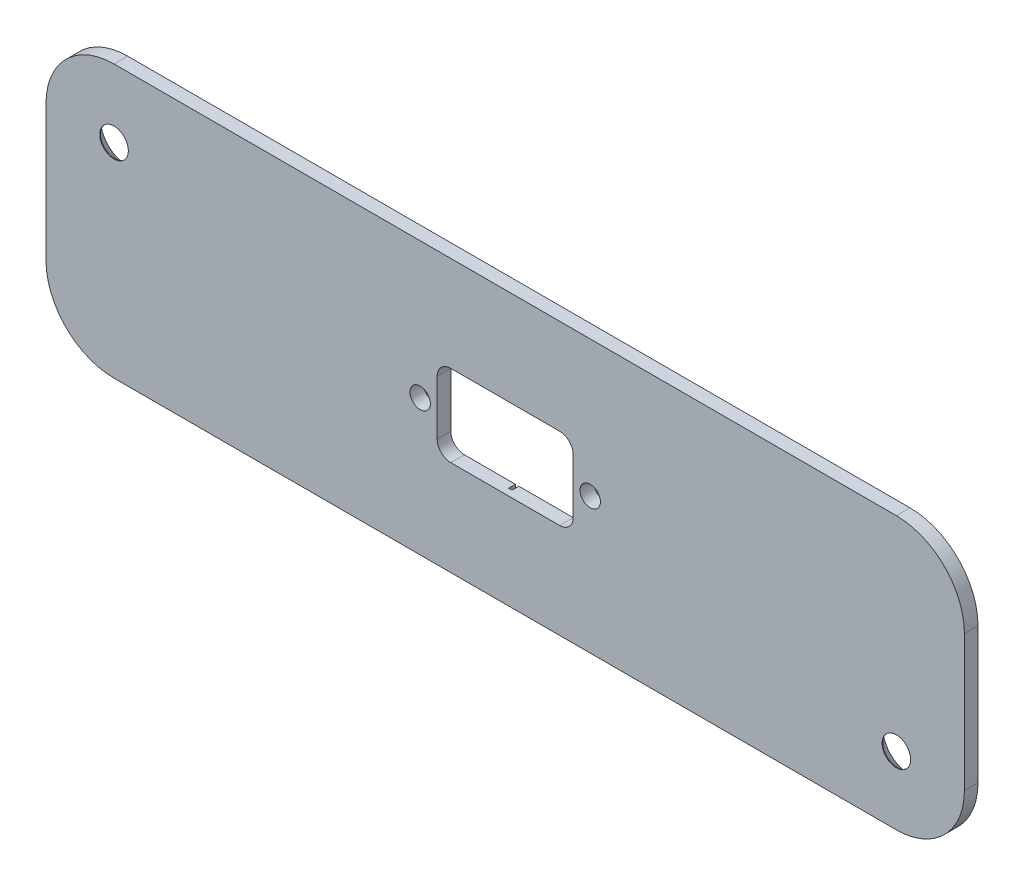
from build123d import *

# Parameters (mm, degrees)
ESQUISSE1_W             = 135
ESQUISSE1_H             = 40
BOSS_EXTRU_1_DEPTH      = 2
ESQUISSE2_R             = 2.1
ENL_V_MAT_EXTRU_1_DEPTH = 2
CHANFREIN1_SIZE         = 1.9
ESQUISSE3_R             = 1.5
ESQUISSE3_W             = 20
ESQUISSE3_H             = 12
ENL_V_MAT_EXTRU_2_DEPTH = 141.815482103
CONG_2_R                = 2
CONG_3_R                = 10
ESQUISSE4_W             = 0.5
ESQUISSE4_H             = 10
ENL_V_MAT_EXTRU_3_DEPTH = 1


with BuildPart() as part:
    # Esquisse1 → Boss.-Extru.1 (new body)
    with BuildSketch(Plane.XY):
        with Locations((67.5, 20)):
            Rectangle(ESQUISSE1_W, ESQUISSE1_H)
    extrude(amount=BOSS_EXTRU_1_DEPTH)

    # Esquisse2 → Enl_v. mat.-Extru.1 (cut)
    with BuildSketch(Plane.XY.offset(2)):
        with Locations((10, 30)):
            Circle(ESQUISSE2_R)
        with Locations((125, 10)):
            Circle(ESQUISSE2_R)
    extrude(amount=-ENL_V_MAT_EXTRU_1_DEPTH, mode=Mode.SUBTRACT)

    # Chanfrein1
    chanfrein1_edges = [part.edges().sort_by_distance(p)[0] for p in [
        (7.9, 30, 0),
        (122.9, 10, 0),
    ]]
    chamfer(chanfrein1_edges, length=CHANFREIN1_SIZE)

    # Esquisse3 → Enl_v. mat.-Extru.2 (cut, through all)
    with BuildSketch(Plane(origin=(0, 0, 0), x_dir=(-1, 0, 0), z_dir=(0, 0, -1))):
        with Locations((-80, 20)):
            Circle(ESQUISSE3_R)
        with Locations((-55, 20)):
            Circle(ESQUISSE3_R)
        with Locations((-67.5, 20)):
            Rectangle(ESQUISSE3_W, ESQUISSE3_H)
    extrude(amount=-ENL_V_MAT_EXTRU_2_DEPTH, mode=Mode.SUBTRACT)

    # Cong_2
    cong_2_edges = [part.edges().sort_by_distance(p)[0] for p in [
        (77.5, 14, 1),
        (77.5, 26, 1),
        (57.5, 26, 1),
        (57.5, 14, 1),
    ]]
    fillet(cong_2_edges, radius=CONG_2_R)

    # Cong_3
    cong_3_edges = [part.edges().sort_by_distance(p)[0] for p in [
        (0, 40, 1),
        (135, 40, 1),
        (135, 0, 1),
        (0, 0, 1),
    ]]
    fillet(cong_3_edges, radius=CONG_3_R)

    # Esquisse4 → Enl_v. mat.-Extru.3 (cut)
    # profile 1 of 9: a face of its own
    with BuildSketch(Plane(origin=(0, 0, 0), x_dir=(-1, 0, 0), z_dir=(0, 0, -1))):
        with Locations((-67.25, 9)):
            Rectangle(ESQUISSE4_W, ESQUISSE4_H)
    # profile 2 of 9: a face of its own
    with BuildSketch(Plane(origin=(0, 0, 0), x_dir=(-1, 0, 0), z_dir=(0, 0, -1))):
        with BuildLine():
            Line((-84.71225634, 8.358894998), (-85.026358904, 8.358894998))
            add(Edge.make_bspline(
                [(-85.026358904, 8.358894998), (-85.017849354, 8.394127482), (-85.001213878, 8.463004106), (-84.966516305, 8.561411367), (-84.92871705, 8.654534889), (-84.883327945, 8.740630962), (-84.833819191, 8.821429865), (-84.777096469, 8.895098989), (-84.715776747, 8.963511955), (-84.647951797, 9.024225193), (-84.576823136, 9.079202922), (-84.501388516, 9.126077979), (-84.423165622, 9.166402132), (-84.341612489, 9.199622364), (-84.256486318, 9.224647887), (-84.168556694, 9.242804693), (-84.077593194, 9.254595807), (-84.015845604, 9.25574657), (-83.984491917, 9.256330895)],
                knots=[0, 0, 0, 0, 1.162005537, 2.271625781, 3.343758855, 4.383309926, 5.390229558, 6.379919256, 7.361854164, 8.333198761, 9.295911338, 10.242430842, 11.177959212, 12.116337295, 13.062827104, 14.020064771, 14.994644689, 16, 16, 16, 16], degree=3))
            add(Edge.make_bspline(
                [(-83.984491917, 9.256330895), (-83.938809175, 9.254951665), (-83.848440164, 9.25222329), (-83.715677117, 9.227308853), (-83.587650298, 9.187883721), (-83.46576105, 9.133409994), (-83.352542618, 9.066222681), (-83.251806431, 8.986257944), (-83.16491792, 8.895058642), (-83.092023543, 8.794326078), (-83.034948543, 8.686670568), (-82.99286217, 8.575870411), (-82.967240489, 8.46218844), (-82.963919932, 8.385431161), (-82.96225634, 8.346975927)],
                knots=[0, 0, 0, 0, 1.083050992, 2.142477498, 3.193116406, 4.255571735, 5.30263384, 6.308962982, 7.297363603, 8.282367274, 9.249857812, 10.179914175, 11.08814088, 12, 12, 12, 12], degree=3))
            add(Edge.make_bspline(
                [(-82.96225634, 8.346975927), (-82.963419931, 8.309969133), (-82.965696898, 8.237552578), (-82.985030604, 8.131831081), (-83.017566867, 8.032189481), (-83.062636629, 7.938208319), (-83.12097818, 7.850483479), (-83.191650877, 7.768817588), (-83.275153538, 7.69284843), (-83.338432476, 7.649328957), (-83.371010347, 7.626923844)],
                knots=[0, 0, 0, 0, 1.024540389, 2.004866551, 2.965041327, 3.920577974, 4.882998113, 5.874504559, 6.905732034, 8, 8, 8, 8], degree=3))
            add(Edge.make_bspline(
                [(-83.371010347, 7.626923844), (-83.333778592, 7.608945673), (-83.260011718, 7.573325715), (-83.159461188, 7.503469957), (-83.068183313, 7.42281361), (-83.017279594, 7.359870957), (-82.991703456, 7.32824596)],
                knots=[0, 0, 0, 0, 1.015518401, 2.012035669, 3.001164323, 4, 4, 4, 4], degree=3))
            add(Edge.make_bspline(
                [(-82.991703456, 7.32824596), (-82.974862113, 7.305188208), (-82.941455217, 7.259450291), (-82.900219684, 7.185913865), (-82.862810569, 7.111562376), (-82.83366035, 7.03440297), (-82.811086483, 6.955329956), (-82.794950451, 6.87420756), (-82.78492631, 6.790969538), (-82.783490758, 6.734657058), (-82.782769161, 6.706350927)],
                knots=[0, 0, 0, 0, 1.025084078, 2.033381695, 3.024893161, 4.013698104, 4.991890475, 5.976764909, 6.982997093, 8, 8, 8, 8], degree=3))
            add(Edge.make_bspline(
                [(-82.782769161, 6.706350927), (-82.784563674, 6.657341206), (-82.788144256, 6.559552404), (-82.820148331, 6.415077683), (-82.869761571, 6.273852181), (-82.940218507, 6.138777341), (-83.026086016, 6.01239696), (-83.12824334, 5.899320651), (-83.245529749, 5.802122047), (-83.376335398, 5.720911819), (-83.518052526, 5.655993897), (-83.669628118, 5.610936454), (-83.828878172, 5.581590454), (-83.93808547, 5.578443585), (-83.993606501, 5.576843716)],
                knots=[0, 0, 0, 0, 0.955779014, 1.907060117, 2.875433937, 3.871313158, 4.872415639, 5.851225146, 6.836215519, 7.83643374, 8.849228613, 9.86973379, 10.916971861, 12, 12, 12, 12], degree=3))
            add(Edge.make_bspline(
                [(-83.993606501, 5.576843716), (-84.031025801, 5.577711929), (-84.104654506, 5.579420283), (-84.212898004, 5.591098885), (-84.316219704, 5.61242889), (-84.414759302, 5.641132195), (-84.508604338, 5.677523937), (-84.597468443, 5.722842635), (-84.681898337, 5.776154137), (-84.761097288, 5.838087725), (-84.835055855, 5.907369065), (-84.90180858, 5.985228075), (-84.962468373, 6.070225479), (-85.015411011, 6.163348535), (-85.063047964, 6.263393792), (-85.102228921, 6.371642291), (-85.136714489, 6.487126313), (-85.152747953, 6.567604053), (-85.160974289, 6.608894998)],
                knots=[0, 0, 0, 0, 1.048658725, 2.063410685, 3.046034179, 4.001477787, 4.936774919, 5.862367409, 6.792675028, 7.730719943, 8.675894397, 9.627829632, 10.600096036, 11.597688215, 12.626045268, 13.701542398, 14.82072376, 16, 16, 16, 16], degree=3))
            Line((-85.160974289, 6.608894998), (-84.846871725, 6.608894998))
            add(Edge.make_bspline(
                [(-84.846871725, 6.608894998), (-84.838688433, 6.581945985), (-84.822771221, 6.529527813), (-84.795676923, 6.454087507), (-84.764808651, 6.384929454), (-84.731694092, 6.321546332), (-84.696915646, 6.26331393), (-84.658000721, 6.211772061), (-84.617831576, 6.164656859), (-84.587552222, 6.138112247), (-84.572733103, 6.12512096)],
                knots=[0, 0, 0, 0, 1.198163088, 2.33053128, 3.407730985, 4.417276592, 5.372219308, 6.28897303, 7.162600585, 8, 8, 8, 8], degree=3))
            add(Edge.make_bspline(
                [(-84.572733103, 6.12512096), (-84.553136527, 6.110012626), (-84.514003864, 6.079842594), (-84.450235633, 6.041340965), (-84.383170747, 6.00797994), (-84.311356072, 5.982496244), (-84.236341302, 5.960918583), (-84.156913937, 5.946798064), (-84.07377472, 5.937109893), (-84.017006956, 5.936254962), (-83.987997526, 5.935818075)],
                knots=[0, 0, 0, 0, 0.946170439, 1.889420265, 2.845303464, 3.807233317, 4.801018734, 5.828864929, 6.890507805, 8, 8, 8, 8], degree=3))
            add(Edge.make_bspline(
                [(-83.987997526, 5.935818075), (-83.955244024, 5.93643398), (-83.891197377, 5.93763833), (-83.797742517, 5.948714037), (-83.70883507, 5.96484445), (-83.625462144, 5.989757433), (-83.546531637, 6.020538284), (-83.473149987, 6.05918669), (-83.404353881, 6.104531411), (-83.341024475, 6.15607057), (-83.284078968, 6.212492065), (-83.233939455, 6.271505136), (-83.191314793, 6.332860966), (-83.156931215, 6.396899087), (-83.129780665, 6.463354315), (-83.111297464, 6.532413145), (-83.098445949, 6.603510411), (-83.097399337, 6.65183938), (-83.096871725, 6.67620269)],
                knots=[0, 0, 0, 0, 1.217147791, 2.380027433, 3.494444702, 4.572153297, 5.609568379, 6.639424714, 7.649109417, 8.668170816, 9.669597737, 10.625200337, 11.543417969, 12.441394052, 13.322311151, 14.205496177, 15.095365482, 16, 16, 16, 16], degree=3))
            add(Edge.make_bspline(
                [(-83.096871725, 6.67620269), (-83.098402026, 6.708814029), (-83.101455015, 6.773874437), (-83.124763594, 6.869592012), (-83.163102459, 6.961815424), (-83.21677497, 7.048971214), (-83.282110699, 7.129747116), (-83.358475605, 7.201818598), (-83.446503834, 7.261288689), (-83.527523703, 7.302377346), (-83.599288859, 7.330414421), (-83.660704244, 7.349089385), (-83.729460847, 7.364903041), (-83.804727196, 7.379615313), (-83.887070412, 7.392136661), (-83.97640085, 7.402578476), (-84.072736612, 7.410933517), (-84.139427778, 7.414664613), (-84.173794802, 7.416587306)],
                knots=[0, 0, 0, 0, 1.07054697, 2.135767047, 3.216561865, 4.33974944, 5.486079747, 6.621378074, 7.775625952, 8.963672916, 9.598146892, 10.304877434, 11.070270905, 11.915000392, 12.823868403, 13.805723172, 14.86925407, 16, 16, 16, 16], degree=3))
            Line((-84.173794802, 7.416587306), (-84.173794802, 7.775561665))
            add(Edge.make_bspline(
                [(-84.173794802, 7.775561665), (-84.130493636, 7.776296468), (-84.04567729, 7.777735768), (-83.921782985, 7.795143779), (-83.803309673, 7.819224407), (-83.692882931, 7.856109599), (-83.592234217, 7.898949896), (-83.504914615, 7.948802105), (-83.432147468, 8.004216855), (-83.374286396, 8.066049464), (-83.330757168, 8.132364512), (-83.29893037, 8.201481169), (-83.280130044, 8.27400523), (-83.277620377, 8.323499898), (-83.276358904, 8.348378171)],
                knots=[0, 0, 0, 0, 1.321986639, 2.589447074, 3.816329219, 5.01088745, 6.139805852, 7.153945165, 8.075214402, 8.924034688, 9.728124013, 10.488707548, 11.240355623, 12, 12, 12, 12], degree=3))
            add(Edge.make_bspline(
                [(-83.276358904, 8.348378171), (-83.276773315, 8.366655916), (-83.277597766, 8.403018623), (-83.287995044, 8.456143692), (-83.303619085, 8.507644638), (-83.325098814, 8.557302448), (-83.353849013, 8.604772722), (-83.388255, 8.650460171), (-83.4292231, 8.69410395), (-83.476168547, 8.73478427), (-83.526580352, 8.773553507), (-83.581830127, 8.806467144), (-83.640252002, 8.834612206), (-83.701910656, 8.857821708), (-83.767006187, 8.875280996), (-83.835232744, 8.887816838), (-83.906720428, 8.895654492), (-83.95549216, 8.896782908), (-83.980285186, 8.897356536)],
                knots=[0, 0, 0, 0, 0.884392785, 1.759457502, 2.611959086, 3.489218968, 4.37281399, 5.2945488, 6.255912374, 7.266815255, 8.301784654, 9.332968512, 10.37626691, 11.440494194, 12.520033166, 13.637162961, 14.798855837, 16, 16, 16, 16], degree=3))
            add(Edge.make_bspline(
                [(-83.980285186, 8.897356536), (-84.020136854, 8.895965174), (-84.097976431, 8.893247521), (-84.210191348, 8.869444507), (-84.314510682, 8.831466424), (-84.394249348, 8.786133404), (-84.453131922, 8.741382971), (-84.495208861, 8.702300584), (-84.536529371, 8.658867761), (-84.574375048, 8.608409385), (-84.612649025, 8.554342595), (-84.647493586, 8.493918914), (-84.681353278, 8.428714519), (-84.701755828, 8.382618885), (-84.71225634, 8.358894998)],
                knots=[0, 0, 0, 0, 1.472543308, 2.876219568, 4.221790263, 5.565193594, 6.249813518, 6.953379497, 7.687249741, 8.463570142, 9.283606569, 10.136032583, 11.040678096, 12, 12, 12, 12], degree=3))
        make_face()
    # profile 3 of 9: a face of its own
    with BuildSketch(Plane(origin=(0, 0, 0), x_dir=(-1, 0, 0), z_dir=(0, 0, -1))):
        with BuildLine():
            Line((-82.019948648, 8.358894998), (-82.334051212, 8.358894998))
            add(Edge.make_bspline(
                [(-82.334051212, 8.358894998), (-82.325541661, 8.394127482), (-82.308906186, 8.463004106), (-82.274208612, 8.561411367), (-82.236409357, 8.654534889), (-82.191020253, 8.740630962), (-82.141511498, 8.821429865), (-82.084788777, 8.895098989), (-82.023469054, 8.963511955), (-81.955644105, 9.024225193), (-81.884515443, 9.079202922), (-81.809080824, 9.126077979), (-81.73085793, 9.166402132), (-81.649304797, 9.199622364), (-81.564178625, 9.224647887), (-81.476249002, 9.242804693), (-81.385285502, 9.254595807), (-81.323537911, 9.25574657), (-81.292184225, 9.256330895)],
                knots=[0, 0, 0, 0, 1.162005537, 2.271625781, 3.343758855, 4.383309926, 5.390229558, 6.379919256, 7.361854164, 8.333198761, 9.295911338, 10.242430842, 11.177959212, 12.116337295, 13.062827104, 14.020064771, 14.994644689, 16, 16, 16, 16], degree=3))
            add(Edge.make_bspline(
                [(-81.292184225, 9.256330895), (-81.246501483, 9.254951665), (-81.156132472, 9.25222329), (-81.023369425, 9.227308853), (-80.895342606, 9.187883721), (-80.773453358, 9.133409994), (-80.660234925, 9.066222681), (-80.559498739, 8.986257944), (-80.472610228, 8.895058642), (-80.39971585, 8.794326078), (-80.342640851, 8.686670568), (-80.300554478, 8.575870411), (-80.274932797, 8.46218844), (-80.27161224, 8.385431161), (-80.269948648, 8.346975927)],
                knots=[0, 0, 0, 0, 1.083050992, 2.142477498, 3.193116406, 4.255571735, 5.30263384, 6.308962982, 7.297363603, 8.282367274, 9.249857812, 10.179914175, 11.08814088, 12, 12, 12, 12], degree=3))
            add(Edge.make_bspline(
                [(-80.269948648, 8.346975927), (-80.271112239, 8.309969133), (-80.273389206, 8.237552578), (-80.292722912, 8.131831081), (-80.325259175, 8.032189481), (-80.370328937, 7.938208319), (-80.428670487, 7.850483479), (-80.499343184, 7.768817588), (-80.582845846, 7.69284843), (-80.646124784, 7.649328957), (-80.678702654, 7.626923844)],
                knots=[0, 0, 0, 0, 1.024540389, 2.004866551, 2.965041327, 3.920577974, 4.882998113, 5.874504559, 6.905732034, 8, 8, 8, 8], degree=3))
            add(Edge.make_bspline(
                [(-80.678702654, 7.626923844), (-80.6414709, 7.608945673), (-80.567704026, 7.573325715), (-80.467153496, 7.503469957), (-80.375875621, 7.42281361), (-80.324971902, 7.359870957), (-80.299395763, 7.32824596)],
                knots=[0, 0, 0, 0, 1.015518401, 2.012035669, 3.001164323, 4, 4, 4, 4], degree=3))
            add(Edge.make_bspline(
                [(-80.299395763, 7.32824596), (-80.282554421, 7.305188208), (-80.249147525, 7.259450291), (-80.207911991, 7.185913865), (-80.170502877, 7.111562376), (-80.141352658, 7.03440297), (-80.118778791, 6.955329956), (-80.102642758, 6.87420756), (-80.092618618, 6.790969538), (-80.091183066, 6.734657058), (-80.090461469, 6.706350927)],
                knots=[0, 0, 0, 0, 1.025084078, 2.033381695, 3.024893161, 4.013698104, 4.991890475, 5.976764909, 6.982997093, 8, 8, 8, 8], degree=3))
            add(Edge.make_bspline(
                [(-80.090461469, 6.706350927), (-80.092255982, 6.657341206), (-80.095836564, 6.559552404), (-80.127840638, 6.415077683), (-80.177453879, 6.273852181), (-80.247910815, 6.138777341), (-80.333778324, 6.01239696), (-80.435935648, 5.899320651), (-80.553222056, 5.802122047), (-80.684027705, 5.720911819), (-80.825744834, 5.655993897), (-80.977320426, 5.610936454), (-81.13657048, 5.581590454), (-81.245777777, 5.578443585), (-81.301298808, 5.576843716)],
                knots=[0, 0, 0, 0, 0.955779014, 1.907060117, 2.875433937, 3.871313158, 4.872415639, 5.851225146, 6.836215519, 7.83643374, 8.849228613, 9.86973379, 10.916971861, 12, 12, 12, 12], degree=3))
            add(Edge.make_bspline(
                [(-81.301298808, 5.576843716), (-81.338718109, 5.577711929), (-81.412346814, 5.579420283), (-81.520590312, 5.591098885), (-81.623912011, 5.61242889), (-81.722451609, 5.641132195), (-81.816296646, 5.677523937), (-81.905160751, 5.722842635), (-81.989590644, 5.776154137), (-82.068789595, 5.838087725), (-82.142748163, 5.907369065), (-82.209500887, 5.985228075), (-82.27016068, 6.070225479), (-82.323103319, 6.163348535), (-82.370740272, 6.263393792), (-82.409921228, 6.371642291), (-82.444406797, 6.487126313), (-82.460440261, 6.567604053), (-82.468666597, 6.608894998)],
                knots=[0, 0, 0, 0, 1.048658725, 2.063410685, 3.046034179, 4.001477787, 4.936774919, 5.862367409, 6.792675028, 7.730719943, 8.675894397, 9.627829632, 10.600096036, 11.597688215, 12.626045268, 13.701542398, 14.82072376, 16, 16, 16, 16], degree=3))
            Line((-82.468666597, 6.608894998), (-82.154564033, 6.608894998))
            add(Edge.make_bspline(
                [(-82.154564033, 6.608894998), (-82.146380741, 6.581945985), (-82.130463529, 6.529527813), (-82.10336923, 6.454087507), (-82.072500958, 6.384929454), (-82.0393864, 6.321546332), (-82.004607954, 6.26331393), (-81.965693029, 6.211772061), (-81.925523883, 6.164656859), (-81.89524453, 6.138112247), (-81.880425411, 6.12512096)],
                knots=[0, 0, 0, 0, 1.198163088, 2.33053128, 3.407730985, 4.417276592, 5.372219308, 6.28897303, 7.162600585, 8, 8, 8, 8], degree=3))
            add(Edge.make_bspline(
                [(-81.880425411, 6.12512096), (-81.860828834, 6.110012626), (-81.821696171, 6.079842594), (-81.75792794, 6.041340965), (-81.690863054, 6.00797994), (-81.61904838, 5.982496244), (-81.54403361, 5.960918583), (-81.464606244, 5.946798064), (-81.381467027, 5.937109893), (-81.324699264, 5.936254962), (-81.295689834, 5.935818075)],
                knots=[0, 0, 0, 0, 0.946170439, 1.889420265, 2.845303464, 3.807233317, 4.801018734, 5.828864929, 6.890507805, 8, 8, 8, 8], degree=3))
            add(Edge.make_bspline(
                [(-81.295689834, 5.935818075), (-81.262936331, 5.93643398), (-81.198889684, 5.93763833), (-81.105434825, 5.948714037), (-81.016527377, 5.96484445), (-80.933154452, 5.989757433), (-80.854223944, 6.020538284), (-80.780842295, 6.05918669), (-80.712046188, 6.104531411), (-80.648716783, 6.15607057), (-80.591771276, 6.212492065), (-80.541631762, 6.271505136), (-80.499007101, 6.332860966), (-80.464623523, 6.396899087), (-80.437472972, 6.463354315), (-80.418989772, 6.532413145), (-80.406138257, 6.603510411), (-80.405091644, 6.65183938), (-80.404564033, 6.67620269)],
                knots=[0, 0, 0, 0, 1.217147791, 2.380027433, 3.494444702, 4.572153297, 5.609568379, 6.639424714, 7.649109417, 8.668170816, 9.669597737, 10.625200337, 11.543417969, 12.441394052, 13.322311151, 14.205496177, 15.095365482, 16, 16, 16, 16], degree=3))
            add(Edge.make_bspline(
                [(-80.404564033, 6.67620269), (-80.406094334, 6.708814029), (-80.409147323, 6.773874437), (-80.432455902, 6.869592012), (-80.470794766, 6.961815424), (-80.524467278, 7.048971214), (-80.589803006, 7.129747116), (-80.666167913, 7.201818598), (-80.754196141, 7.261288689), (-80.83521601, 7.302377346), (-80.906981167, 7.330414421), (-80.968396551, 7.349089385), (-81.037153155, 7.364903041), (-81.112419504, 7.379615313), (-81.19476272, 7.392136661), (-81.284093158, 7.402578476), (-81.38042892, 7.410933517), (-81.447120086, 7.414664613), (-81.48148711, 7.416587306)],
                knots=[0, 0, 0, 0, 1.07054697, 2.135767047, 3.216561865, 4.33974944, 5.486079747, 6.621378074, 7.775625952, 8.963672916, 9.598146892, 10.304877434, 11.070270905, 11.915000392, 12.823868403, 13.805723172, 14.86925407, 16, 16, 16, 16], degree=3))
            Line((-81.48148711, 7.416587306), (-81.48148711, 7.775561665))
            add(Edge.make_bspline(
                [(-81.48148711, 7.775561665), (-81.438185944, 7.776296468), (-81.353369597, 7.777735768), (-81.229475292, 7.795143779), (-81.11100198, 7.819224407), (-81.000575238, 7.856109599), (-80.899926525, 7.898949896), (-80.812606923, 7.948802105), (-80.739839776, 8.004216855), (-80.681978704, 8.066049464), (-80.638449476, 8.132364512), (-80.606622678, 8.201481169), (-80.587822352, 8.27400523), (-80.585312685, 8.323499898), (-80.584051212, 8.348378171)],
                knots=[0, 0, 0, 0, 1.321986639, 2.589447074, 3.816329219, 5.01088745, 6.139805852, 7.153945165, 8.075214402, 8.924034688, 9.728124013, 10.488707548, 11.240355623, 12, 12, 12, 12], degree=3))
            add(Edge.make_bspline(
                [(-80.584051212, 8.348378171), (-80.584465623, 8.366655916), (-80.585290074, 8.403018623), (-80.595687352, 8.456143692), (-80.611311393, 8.507644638), (-80.632791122, 8.557302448), (-80.661541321, 8.604772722), (-80.695947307, 8.650460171), (-80.736915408, 8.69410395), (-80.783860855, 8.73478427), (-80.83427266, 8.773553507), (-80.889522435, 8.806467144), (-80.947944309, 8.834612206), (-81.009602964, 8.857821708), (-81.074698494, 8.875280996), (-81.142925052, 8.887816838), (-81.214412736, 8.895654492), (-81.263184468, 8.896782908), (-81.287977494, 8.897356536)],
                knots=[0, 0, 0, 0, 0.884392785, 1.759457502, 2.611959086, 3.489218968, 4.37281399, 5.2945488, 6.255912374, 7.266815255, 8.301784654, 9.332968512, 10.37626691, 11.440494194, 12.520033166, 13.637162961, 14.798855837, 16, 16, 16, 16], degree=3))
            add(Edge.make_bspline(
                [(-81.287977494, 8.897356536), (-81.327829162, 8.895965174), (-81.405668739, 8.893247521), (-81.517883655, 8.869444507), (-81.622202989, 8.831466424), (-81.701941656, 8.786133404), (-81.76082423, 8.741382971), (-81.802901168, 8.702300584), (-81.844221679, 8.658867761), (-81.882067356, 8.608409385), (-81.920341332, 8.554342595), (-81.955185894, 8.493918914), (-81.989045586, 8.428714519), (-82.009448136, 8.382618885), (-82.019948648, 8.358894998)],
                knots=[0, 0, 0, 0, 1.472543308, 2.876219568, 4.221790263, 5.565193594, 6.249813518, 6.953379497, 7.687249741, 8.463570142, 9.283606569, 10.136032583, 11.040678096, 12, 12, 12, 12], degree=3))
        make_face()
    # profile 4 of 9: a face of its own
    with BuildSketch(Plane(origin=(0, 0, 0), x_dir=(-1, 0, 0), z_dir=(0, 0, -1))):
        Polygon((-78.385333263, 9.166587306), (-78.048794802, 9.166587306), (-76.882128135, 6.408374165), (-75.715461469, 9.166587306), (-75.378923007, 9.166587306), (-76.859692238, 5.666587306), (-76.904564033, 5.666587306), align=None)
    # profile 5 of 9: a face of its own
    with BuildSketch(Plane(origin=(0, 0, 0), x_dir=(-1, 0, 0), z_dir=(0, 0, -1))):
        with BuildLine():
            Line((-71.519948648, 8.524359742), (-71.794788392, 8.314023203))
            add(Edge.make_bspline(
                [(-71.794788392, 8.314023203), (-71.81439428, 8.337389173), (-71.853341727, 8.383806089), (-71.916000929, 8.448985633), (-71.981302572, 8.510050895), (-72.049221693, 8.567292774), (-72.120980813, 8.61870954), (-72.194841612, 8.666980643), (-72.272039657, 8.710248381), (-72.378791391, 8.762711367), (-72.51843924, 8.817457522), (-72.694234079, 8.863360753), (-72.877745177, 8.892581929), (-73.002942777, 8.89574677), (-73.066623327, 8.897356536)],
                knots=[0, 0, 0, 0, 0.757959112, 1.505699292, 2.245454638, 2.979532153, 3.711538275, 4.438200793, 5.171680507, 5.909471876, 7.393775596, 8.890124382, 10.418191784, 12, 12, 12, 12], degree=3))
            add(Edge.make_bspline(
                [(-73.066623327, 8.897356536), (-73.101706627, 8.896952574), (-73.171547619, 8.896148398), (-73.275196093, 8.885539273), (-73.376909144, 8.870628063), (-73.47662061, 8.84850274), (-73.574203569, 8.820530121), (-73.670295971, 8.787104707), (-73.763506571, 8.745749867), (-73.855124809, 8.700041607), (-73.94290402, 8.648414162), (-74.025959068, 8.59210081), (-74.103987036, 8.531731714), (-74.177049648, 8.467080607), (-74.245221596, 8.398438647), (-74.308008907, 8.325074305), (-74.365194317, 8.247222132), (-74.417911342, 8.165908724), (-74.465124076, 8.081370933), (-74.504653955, 7.993295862), (-74.539659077, 7.903191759), (-74.56735832, 7.810040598), (-74.589282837, 7.714497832), (-74.6044105, 7.616307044), (-74.614898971, 7.515673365), (-74.615699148, 7.447464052), (-74.616102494, 7.413081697)],
                knots=[0, 0, 0, 0, 1.054917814, 2.100044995, 3.131103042, 4.146048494, 5.169673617, 6.183595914, 7.203665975, 8.234915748, 9.262203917, 10.264457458, 11.251630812, 12.227803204, 13.197192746, 14.159520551, 15.12972552, 16.100847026, 17.073214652, 18.039054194, 19.002613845, 19.979014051, 20.95965708, 21.949030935, 22.966165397, 24, 24, 24, 24], degree=3))
            add(Edge.make_bspline(
                [(-74.616102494, 7.413081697), (-74.614840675, 7.361350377), (-74.612363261, 7.259782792), (-74.590314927, 7.111012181), (-74.556809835, 6.968491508), (-74.506594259, 6.833111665), (-74.444675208, 6.703203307), (-74.366434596, 6.580964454), (-74.275818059, 6.464547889), (-74.17154364, 6.356704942), (-74.057137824, 6.258191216), (-73.934389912, 6.171440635), (-73.803605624, 6.099125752), (-73.666228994, 6.038949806), (-73.52120288, 5.992693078), (-73.368788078, 5.960128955), (-73.209316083, 5.938886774), (-73.100346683, 5.936853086), (-73.044888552, 5.935818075)],
                knots=[0, 0, 0, 0, 1.029171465, 2.020641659, 2.987623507, 3.938342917, 4.889210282, 5.84687017, 6.821220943, 7.821438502, 8.827599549, 9.822697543, 10.807740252, 11.797342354, 12.80366471, 13.83203677, 14.896651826, 16, 16, 16, 16], degree=3))
            add(Edge.make_bspline(
                [(-73.044888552, 5.935818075), (-72.983785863, 5.937506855), (-72.863521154, 5.940830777), (-72.687153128, 5.968990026), (-72.518317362, 6.014647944), (-72.357004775, 6.078545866), (-72.203670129, 6.161611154), (-72.058073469, 6.262309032), (-71.920091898, 6.381597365), (-71.837120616, 6.472680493), (-71.794788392, 6.519151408)],
                knots=[0, 0, 0, 0, 1.028121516, 2.023589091, 2.998037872, 3.967518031, 4.937445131, 5.927275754, 6.942489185, 8, 8, 8, 8], degree=3))
            Line((-71.794788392, 6.519151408), (-71.519948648, 6.310918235))
            add(Edge.make_bspline(
                [(-71.519948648, 6.310918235), (-71.542066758, 6.282379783), (-71.586197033, 6.225439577), (-71.65765505, 6.145167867), (-71.732932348, 6.069663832), (-71.812588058, 5.999536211), (-71.895705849, 5.933381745), (-71.983778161, 5.873079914), (-72.075647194, 5.817789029), (-72.171001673, 5.767162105), (-72.269740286, 5.722244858), (-72.371744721, 5.68379109), (-72.476575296, 5.6506662), (-72.584236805, 5.623414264), (-72.694952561, 5.60214318), (-72.808323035, 5.587923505), (-72.924592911, 5.578181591), (-73.003034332, 5.577293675), (-73.042785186, 5.576843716)],
                knots=[0, 0, 0, 0, 0.986787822, 1.968848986, 2.935600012, 3.899624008, 4.868462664, 5.837806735, 6.815139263, 7.798259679, 8.787526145, 9.778297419, 10.776456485, 11.791383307, 12.812564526, 13.85620153, 14.913611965, 16, 16, 16, 16], degree=3))
            add(Edge.make_bspline(
                [(-73.042785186, 5.576843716), (-73.080428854, 5.577105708), (-73.154864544, 5.577623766), (-73.264763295, 5.586015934), (-73.371752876, 5.597465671), (-73.475527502, 5.614705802), (-73.576653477, 5.635050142), (-73.674214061, 5.662321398), (-73.769169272, 5.692870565), (-73.861137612, 5.728775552), (-73.950197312, 5.769291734), (-74.036061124, 5.815083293), (-74.118689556, 5.865765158), (-74.198894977, 5.920220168), (-74.275492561, 5.98019747), (-74.349146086, 6.044864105), (-74.420268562, 6.114002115), (-74.464271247, 6.163856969), (-74.486394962, 6.188923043)],
                knots=[0, 0, 0, 0, 1.114604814, 2.203992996, 3.262667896, 4.300477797, 5.318619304, 6.316056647, 7.298880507, 8.271930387, 9.238335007, 10.195173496, 11.151986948, 12.108099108, 13.064862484, 14.031167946, 15.010108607, 16, 16, 16, 16], degree=3))
            add(Edge.make_bspline(
                [(-74.486394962, 6.188923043), (-74.521830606, 6.232464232), (-74.592274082, 6.319020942), (-74.682399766, 6.459306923), (-74.759547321, 6.605775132), (-74.821923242, 6.759195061), (-74.870685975, 6.919222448), (-74.90446717, 7.085937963), (-74.926418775, 7.259185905), (-74.928929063, 7.377022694), (-74.930205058, 7.436919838)],
                knots=[0, 0, 0, 0, 0.994628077, 1.977248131, 2.950237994, 3.925870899, 4.908910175, 5.911660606, 6.938484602, 8, 8, 8, 8], degree=3))
            add(Edge.make_bspline(
                [(-74.930205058, 7.436919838), (-74.928649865, 7.499875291), (-74.925590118, 7.623736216), (-74.899594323, 7.805510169), (-74.857775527, 7.979661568), (-74.798378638, 8.145865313), (-74.723073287, 8.304995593), (-74.630046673, 8.455836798), (-74.520379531, 8.599353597), (-74.394931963, 8.733368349), (-74.257364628, 8.855907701), (-74.110045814, 8.963713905), (-73.953263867, 9.053431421), (-73.788746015, 9.128427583), (-73.615260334, 9.186072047), (-73.433176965, 9.226425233), (-73.24283805, 9.25154235), (-73.112975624, 9.254717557), (-73.046991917, 9.256330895)],
                knots=[0, 0, 0, 0, 1.032925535, 2.032216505, 3.007276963, 3.968222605, 4.92396291, 5.891752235, 6.871517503, 7.883894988, 8.900124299, 9.891468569, 10.874487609, 11.85992873, 12.854644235, 13.869047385, 14.917252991, 16, 16, 16, 16], degree=3))
            add(Edge.make_bspline(
                [(-73.046991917, 9.256330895), (-73.006777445, 9.255848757), (-72.927176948, 9.254894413), (-72.809424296, 9.245588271), (-72.694781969, 9.230074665), (-72.583170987, 9.208958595), (-72.47404837, 9.182751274), (-72.36824813, 9.148610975), (-72.265149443, 9.109574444), (-72.165402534, 9.064615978), (-72.069485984, 9.014149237), (-71.977429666, 8.958733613), (-71.889964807, 8.898437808), (-71.806475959, 8.833774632), (-71.728359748, 8.763376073), (-71.653398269, 8.689178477), (-71.584137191, 8.609044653), (-71.541383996, 8.552639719), (-71.519948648, 8.524359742)],
                knots=[0, 0, 0, 0, 1.096760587, 2.17092713, 3.219439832, 4.250915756, 5.268269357, 6.278326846, 7.281116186, 8.274029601, 9.260640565, 10.235837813, 11.203064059, 12.156899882, 13.114053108, 14.069676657, 15.032185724, 16, 16, 16, 16], degree=3))
        make_face()
    # profile 6 of 9: a face of its own
    with BuildSketch(Plane(origin=(0, 0, 0), x_dir=(-1, 0, 0), z_dir=(0, 0, -1))):
        with BuildLine():
            Line((-62.415836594, 8.358894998), (-62.729939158, 8.358894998))
            add(Edge.make_bspline(
                [(-62.729939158, 8.358894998), (-62.721429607, 8.394127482), (-62.704794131, 8.463004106), (-62.670096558, 8.561411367), (-62.632297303, 8.654534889), (-62.586908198, 8.740630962), (-62.537399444, 8.821429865), (-62.480676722, 8.895098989), (-62.419357, 8.963511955), (-62.351532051, 9.024225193), (-62.280403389, 9.079202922), (-62.204968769, 9.126077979), (-62.126745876, 9.166402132), (-62.045192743, 9.199622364), (-61.960066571, 9.224647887), (-61.872136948, 9.242804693), (-61.781173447, 9.254595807), (-61.719425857, 9.25574657), (-61.68807217, 9.256330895)],
                knots=[0, 0, 0, 0, 1.162005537, 2.271625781, 3.343758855, 4.383309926, 5.390229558, 6.379919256, 7.361854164, 8.333198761, 9.295911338, 10.242430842, 11.177959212, 12.116337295, 13.062827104, 14.020064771, 14.994644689, 16, 16, 16, 16], degree=3))
            add(Edge.make_bspline(
                [(-61.68807217, 9.256330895), (-61.642389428, 9.254951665), (-61.552020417, 9.25222329), (-61.419257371, 9.227308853), (-61.291230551, 9.187883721), (-61.169341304, 9.133409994), (-61.056122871, 9.066222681), (-60.955386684, 8.986257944), (-60.868498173, 8.895058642), (-60.795603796, 8.794326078), (-60.738528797, 8.686670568), (-60.696442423, 8.575870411), (-60.670820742, 8.46218844), (-60.667500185, 8.385431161), (-60.665836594, 8.346975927)],
                knots=[0, 0, 0, 0, 1.083050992, 2.142477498, 3.193116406, 4.255571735, 5.30263384, 6.308962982, 7.297363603, 8.282367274, 9.249857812, 10.179914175, 11.08814088, 12, 12, 12, 12], degree=3))
            add(Edge.make_bspline(
                [(-60.665836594, 8.346975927), (-60.667000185, 8.309969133), (-60.669277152, 8.237552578), (-60.688610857, 8.131831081), (-60.72114712, 8.032189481), (-60.766216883, 7.938208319), (-60.824558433, 7.850483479), (-60.89523113, 7.768817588), (-60.978733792, 7.69284843), (-61.04201273, 7.649328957), (-61.0745906, 7.626923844)],
                knots=[0, 0, 0, 0, 1.024540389, 2.004866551, 2.965041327, 3.920577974, 4.882998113, 5.874504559, 6.905732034, 8, 8, 8, 8], degree=3))
            add(Edge.make_bspline(
                [(-61.0745906, 7.626923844), (-61.037358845, 7.608945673), (-60.963591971, 7.573325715), (-60.863041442, 7.503469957), (-60.771763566, 7.42281361), (-60.720859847, 7.359870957), (-60.695283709, 7.32824596)],
                knots=[0, 0, 0, 0, 1.015518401, 2.012035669, 3.001164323, 4, 4, 4, 4], degree=3))
            add(Edge.make_bspline(
                [(-60.695283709, 7.32824596), (-60.678442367, 7.305188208), (-60.645035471, 7.259450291), (-60.603799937, 7.185913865), (-60.566390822, 7.111562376), (-60.537240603, 7.03440297), (-60.514666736, 6.955329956), (-60.498530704, 6.87420756), (-60.488506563, 6.790969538), (-60.487071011, 6.734657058), (-60.486349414, 6.706350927)],
                knots=[0, 0, 0, 0, 1.025084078, 2.033381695, 3.024893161, 4.013698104, 4.991890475, 5.976764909, 6.982997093, 8, 8, 8, 8], degree=3))
            add(Edge.make_bspline(
                [(-60.486349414, 6.706350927), (-60.488143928, 6.657341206), (-60.49172451, 6.559552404), (-60.523728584, 6.415077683), (-60.573341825, 6.273852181), (-60.643798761, 6.138777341), (-60.729666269, 6.01239696), (-60.831823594, 5.899320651), (-60.949110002, 5.802122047), (-61.079915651, 5.720911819), (-61.221632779, 5.655993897), (-61.373208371, 5.610936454), (-61.532458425, 5.581590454), (-61.641665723, 5.578443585), (-61.697186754, 5.576843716)],
                knots=[0, 0, 0, 0, 0.955779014, 1.907060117, 2.875433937, 3.871313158, 4.872415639, 5.851225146, 6.836215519, 7.83643374, 8.849228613, 9.86973379, 10.916971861, 12, 12, 12, 12], degree=3))
            add(Edge.make_bspline(
                [(-61.697186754, 5.576843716), (-61.734606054, 5.577711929), (-61.808234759, 5.579420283), (-61.916478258, 5.591098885), (-62.019799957, 5.61242889), (-62.118339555, 5.641132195), (-62.212184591, 5.677523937), (-62.301048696, 5.722842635), (-62.38547859, 5.776154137), (-62.464677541, 5.838087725), (-62.538636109, 5.907369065), (-62.605388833, 5.985228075), (-62.666048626, 6.070225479), (-62.718991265, 6.163348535), (-62.766628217, 6.263393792), (-62.805809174, 6.371642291), (-62.840294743, 6.487126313), (-62.856328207, 6.567604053), (-62.864554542, 6.608894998)],
                knots=[0, 0, 0, 0, 1.048658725, 2.063410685, 3.046034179, 4.001477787, 4.936774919, 5.862367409, 6.792675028, 7.730719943, 8.675894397, 9.627829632, 10.600096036, 11.597688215, 12.626045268, 13.701542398, 14.82072376, 16, 16, 16, 16], degree=3))
            Line((-62.864554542, 6.608894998), (-62.550451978, 6.608894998))
            add(Edge.make_bspline(
                [(-62.550451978, 6.608894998), (-62.542268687, 6.581945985), (-62.526351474, 6.529527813), (-62.499257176, 6.454087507), (-62.468388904, 6.384929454), (-62.435274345, 6.321546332), (-62.400495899, 6.26331393), (-62.361580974, 6.211772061), (-62.321411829, 6.164656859), (-62.291132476, 6.138112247), (-62.276313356, 6.12512096)],
                knots=[0, 0, 0, 0, 1.198163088, 2.33053128, 3.407730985, 4.417276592, 5.372219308, 6.28897303, 7.162600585, 8, 8, 8, 8], degree=3))
            add(Edge.make_bspline(
                [(-62.276313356, 6.12512096), (-62.25671678, 6.110012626), (-62.217584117, 6.079842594), (-62.153815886, 6.041340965), (-62.086751, 6.00797994), (-62.014936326, 5.982496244), (-61.939921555, 5.960918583), (-61.86049419, 5.946798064), (-61.777354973, 5.937109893), (-61.720587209, 5.936254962), (-61.691577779, 5.935818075)],
                knots=[0, 0, 0, 0, 0.946170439, 1.889420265, 2.845303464, 3.807233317, 4.801018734, 5.828864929, 6.890507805, 8, 8, 8, 8], degree=3))
            add(Edge.make_bspline(
                [(-61.691577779, 5.935818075), (-61.658824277, 5.93643398), (-61.59477763, 5.93763833), (-61.501322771, 5.948714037), (-61.412415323, 5.96484445), (-61.329042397, 5.989757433), (-61.25011189, 6.020538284), (-61.17673024, 6.05918669), (-61.107934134, 6.104531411), (-61.044604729, 6.15607057), (-60.987659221, 6.212492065), (-60.937519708, 6.271505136), (-60.894895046, 6.332860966), (-60.860511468, 6.396899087), (-60.833360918, 6.463354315), (-60.814877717, 6.532413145), (-60.802026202, 6.603510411), (-60.80097959, 6.65183938), (-60.800451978, 6.67620269)],
                knots=[0, 0, 0, 0, 1.217147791, 2.380027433, 3.494444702, 4.572153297, 5.609568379, 6.639424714, 7.649109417, 8.668170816, 9.669597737, 10.625200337, 11.543417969, 12.441394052, 13.322311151, 14.205496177, 15.095365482, 16, 16, 16, 16], degree=3))
            add(Edge.make_bspline(
                [(-60.800451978, 6.67620269), (-60.80198228, 6.708814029), (-60.805035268, 6.773874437), (-60.828343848, 6.869592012), (-60.866682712, 6.961815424), (-60.920355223, 7.048971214), (-60.985690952, 7.129747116), (-61.062055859, 7.201818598), (-61.150084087, 7.261288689), (-61.231103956, 7.302377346), (-61.302869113, 7.330414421), (-61.364284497, 7.349089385), (-61.4330411, 7.364903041), (-61.508307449, 7.379615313), (-61.590650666, 7.392136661), (-61.679981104, 7.402578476), (-61.776316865, 7.410933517), (-61.843008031, 7.414664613), (-61.877375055, 7.416587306)],
                knots=[0, 0, 0, 0, 1.07054697, 2.135767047, 3.216561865, 4.33974944, 5.486079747, 6.621378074, 7.775625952, 8.963672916, 9.598146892, 10.304877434, 11.070270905, 11.915000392, 12.823868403, 13.805723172, 14.86925407, 16, 16, 16, 16], degree=3))
            Line((-61.877375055, 7.416587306), (-61.877375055, 7.775561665))
            add(Edge.make_bspline(
                [(-61.877375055, 7.775561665), (-61.834073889, 7.776296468), (-61.749257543, 7.777735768), (-61.625363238, 7.795143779), (-61.506889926, 7.819224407), (-61.396463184, 7.856109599), (-61.295814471, 7.898949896), (-61.208494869, 7.948802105), (-61.135727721, 8.004216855), (-61.07786665, 8.066049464), (-61.034337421, 8.132364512), (-61.002510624, 8.201481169), (-60.983710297, 8.27400523), (-60.98120063, 8.323499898), (-60.979939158, 8.348378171)],
                knots=[0, 0, 0, 0, 1.321986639, 2.589447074, 3.816329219, 5.01088745, 6.139805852, 7.153945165, 8.075214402, 8.924034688, 9.728124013, 10.488707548, 11.240355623, 12, 12, 12, 12], degree=3))
            add(Edge.make_bspline(
                [(-60.979939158, 8.348378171), (-60.980353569, 8.366655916), (-60.98117802, 8.403018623), (-60.991575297, 8.456143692), (-61.007199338, 8.507644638), (-61.028679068, 8.557302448), (-61.057429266, 8.604772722), (-61.091835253, 8.650460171), (-61.132803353, 8.69410395), (-61.1797488, 8.73478427), (-61.230160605, 8.773553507), (-61.28541038, 8.806467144), (-61.343832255, 8.834612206), (-61.40549091, 8.857821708), (-61.47058644, 8.875280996), (-61.538812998, 8.887816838), (-61.610300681, 8.895654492), (-61.659072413, 8.896782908), (-61.68386544, 8.897356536)],
                knots=[0, 0, 0, 0, 0.884392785, 1.759457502, 2.611959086, 3.489218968, 4.37281399, 5.2945488, 6.255912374, 7.266815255, 8.301784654, 9.332968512, 10.37626691, 11.440494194, 12.520033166, 13.637162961, 14.798855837, 16, 16, 16, 16], degree=3))
            add(Edge.make_bspline(
                [(-61.68386544, 8.897356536), (-61.723717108, 8.895965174), (-61.801556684, 8.893247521), (-61.913771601, 8.869444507), (-62.018090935, 8.831466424), (-62.097829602, 8.786133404), (-62.156712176, 8.741382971), (-62.198789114, 8.702300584), (-62.240109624, 8.658867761), (-62.277955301, 8.608409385), (-62.316229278, 8.554342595), (-62.351073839, 8.493918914), (-62.384933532, 8.428714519), (-62.405336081, 8.382618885), (-62.415836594, 8.358894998)],
                knots=[0, 0, 0, 0, 1.472543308, 2.876219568, 4.221790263, 5.565193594, 6.249813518, 6.953379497, 7.687249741, 8.463570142, 9.283606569, 10.136032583, 11.040678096, 12, 12, 12, 12], degree=3))
        make_face()
    # profile 7 of 9: a face of its own
    with BuildSketch(Plane(origin=(0, 0, 0), x_dir=(-1, 0, 0), z_dir=(0, 0, -1))):
        Polygon((-58.261689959, 9.256330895), (-58.197887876, 9.256330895), (-58.197887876, 6.833253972), (-57.794041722, 6.833253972), (-57.794041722, 6.474279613), (-58.197887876, 6.474279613), (-58.197887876, 5.666587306), (-58.51199044, 5.666587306), (-58.51199044, 6.474279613), (-60.17224685, 6.474279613), align=None)
        Polygon((-58.51199044, 6.833253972), (-58.51199044, 8.353286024), (-59.55525967, 6.833253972), align=None, mode=Mode.SUBTRACT)
    # profile 8 of 9: a face of its own
    with BuildSketch(Plane(origin=(0, 0, 0), x_dir=(-1, 0, 0), z_dir=(0, 0, -1))):
        Polygon((-56.088913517, 9.166587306), (-55.752375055, 9.166587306), (-54.585708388, 6.408374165), (-53.419041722, 9.166587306), (-53.08250326, 9.166587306), (-54.563272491, 5.666587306), (-54.608144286, 5.666587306), align=None)
    # profile 9 of 9: a face of its own
    with BuildSketch(Plane(origin=(0, 0, 0), x_dir=(-1, 0, 0), z_dir=(0, 0, -1))):
        with BuildLine():
            Line((-49.223528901, 8.524359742), (-49.498368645, 8.314023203))
            add(Edge.make_bspline(
                [(-49.498368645, 8.314023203), (-49.517974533, 8.337389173), (-49.55692198, 8.383806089), (-49.619581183, 8.448985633), (-49.684882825, 8.510050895), (-49.752801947, 8.567292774), (-49.824561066, 8.61870954), (-49.898421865, 8.666980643), (-49.97561991, 8.710248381), (-50.082371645, 8.762711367), (-50.222019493, 8.817457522), (-50.397814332, 8.863360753), (-50.581325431, 8.892581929), (-50.70652303, 8.89574677), (-50.770203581, 8.897356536)],
                knots=[0, 0, 0, 0, 0.757959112, 1.505699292, 2.245454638, 2.979532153, 3.711538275, 4.438200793, 5.171680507, 5.909471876, 7.393775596, 8.890124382, 10.418191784, 12, 12, 12, 12], degree=3))
            add(Edge.make_bspline(
                [(-50.770203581, 8.897356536), (-50.80528688, 8.896952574), (-50.875127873, 8.896148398), (-50.978776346, 8.885539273), (-51.080489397, 8.870628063), (-51.180200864, 8.84850274), (-51.277783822, 8.820530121), (-51.373876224, 8.787104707), (-51.467086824, 8.745749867), (-51.558705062, 8.700041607), (-51.646484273, 8.648414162), (-51.729539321, 8.59210081), (-51.807567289, 8.531731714), (-51.880629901, 8.467080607), (-51.948801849, 8.398438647), (-52.01158916, 8.325074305), (-52.06877457, 8.247222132), (-52.121491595, 8.165908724), (-52.168704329, 8.081370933), (-52.208234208, 7.993295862), (-52.24323933, 7.903191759), (-52.270938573, 7.810040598), (-52.29286309, 7.714497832), (-52.307990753, 7.616307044), (-52.318479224, 7.515673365), (-52.319279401, 7.447464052), (-52.319682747, 7.413081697)],
                knots=[0, 0, 0, 0, 1.054917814, 2.100044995, 3.131103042, 4.146048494, 5.169673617, 6.183595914, 7.203665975, 8.234915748, 9.262203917, 10.264457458, 11.251630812, 12.227803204, 13.197192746, 14.159520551, 15.12972552, 16.100847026, 17.073214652, 18.039054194, 19.002613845, 19.979014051, 20.95965708, 21.949030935, 22.966165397, 24, 24, 24, 24], degree=3))
            add(Edge.make_bspline(
                [(-52.319682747, 7.413081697), (-52.318420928, 7.361350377), (-52.315943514, 7.259782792), (-52.29389518, 7.111012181), (-52.260390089, 6.968491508), (-52.210174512, 6.833111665), (-52.148255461, 6.703203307), (-52.07001485, 6.580964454), (-51.979398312, 6.464547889), (-51.875123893, 6.356704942), (-51.760718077, 6.258191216), (-51.637970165, 6.171440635), (-51.507185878, 6.099125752), (-51.369809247, 6.038949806), (-51.224783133, 5.992693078), (-51.072368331, 5.960128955), (-50.912896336, 5.938886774), (-50.803926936, 5.936853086), (-50.748468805, 5.935818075)],
                knots=[0, 0, 0, 0, 1.029171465, 2.020641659, 2.987623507, 3.938342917, 4.889210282, 5.84687017, 6.821220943, 7.821438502, 8.827599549, 9.822697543, 10.807740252, 11.797342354, 12.80366471, 13.83203677, 14.896651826, 16, 16, 16, 16], degree=3))
            add(Edge.make_bspline(
                [(-50.748468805, 5.935818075), (-50.687366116, 5.937506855), (-50.567101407, 5.940830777), (-50.390733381, 5.968990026), (-50.221897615, 6.014647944), (-50.060585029, 6.078545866), (-49.907250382, 6.161611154), (-49.761653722, 6.262309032), (-49.623672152, 6.381597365), (-49.540700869, 6.472680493), (-49.498368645, 6.519151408)],
                knots=[0, 0, 0, 0, 1.028121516, 2.023589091, 2.998037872, 3.967518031, 4.937445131, 5.927275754, 6.942489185, 8, 8, 8, 8], degree=3))
            Line((-49.498368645, 6.519151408), (-49.223528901, 6.310918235))
            add(Edge.make_bspline(
                [(-49.223528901, 6.310918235), (-49.245647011, 6.282379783), (-49.289777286, 6.225439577), (-49.361235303, 6.145167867), (-49.436512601, 6.069663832), (-49.516168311, 5.999536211), (-49.599286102, 5.933381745), (-49.687358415, 5.873079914), (-49.779227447, 5.817789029), (-49.874581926, 5.767162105), (-49.973320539, 5.722244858), (-50.075324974, 5.68379109), (-50.180155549, 5.6506662), (-50.287817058, 5.623414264), (-50.398532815, 5.60214318), (-50.511903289, 5.587923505), (-50.628173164, 5.578181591), (-50.706614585, 5.577293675), (-50.74636544, 5.576843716)],
                knots=[0, 0, 0, 0, 0.986787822, 1.968848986, 2.935600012, 3.899624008, 4.868462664, 5.837806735, 6.815139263, 7.798259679, 8.787526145, 9.778297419, 10.776456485, 11.791383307, 12.812564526, 13.85620153, 14.913611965, 16, 16, 16, 16], degree=3))
            add(Edge.make_bspline(
                [(-50.74636544, 5.576843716), (-50.784009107, 5.577105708), (-50.858444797, 5.577623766), (-50.968343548, 5.586015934), (-51.075333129, 5.597465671), (-51.179107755, 5.614705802), (-51.28023373, 5.635050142), (-51.377794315, 5.662321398), (-51.472749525, 5.692870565), (-51.564717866, 5.728775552), (-51.653777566, 5.769291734), (-51.739641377, 5.815083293), (-51.822269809, 5.865765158), (-51.90247523, 5.920220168), (-51.979072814, 5.98019747), (-52.052726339, 6.044864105), (-52.123848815, 6.114002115), (-52.1678515, 6.163856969), (-52.189975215, 6.188923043)],
                knots=[0, 0, 0, 0, 1.114604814, 2.203992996, 3.262667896, 4.300477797, 5.318619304, 6.316056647, 7.298880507, 8.271930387, 9.238335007, 10.195173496, 11.151986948, 12.108099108, 13.064862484, 14.031167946, 15.010108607, 16, 16, 16, 16], degree=3))
            add(Edge.make_bspline(
                [(-52.189975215, 6.188923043), (-52.225410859, 6.232464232), (-52.295854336, 6.319020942), (-52.385980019, 6.459306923), (-52.463127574, 6.605775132), (-52.525503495, 6.759195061), (-52.574266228, 6.919222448), (-52.608047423, 7.085937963), (-52.629999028, 7.259185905), (-52.632509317, 7.377022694), (-52.633785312, 7.436919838)],
                knots=[0, 0, 0, 0, 0.994628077, 1.977248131, 2.950237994, 3.925870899, 4.908910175, 5.911660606, 6.938484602, 8, 8, 8, 8], degree=3))
            add(Edge.make_bspline(
                [(-52.633785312, 7.436919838), (-52.632230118, 7.499875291), (-52.629170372, 7.623736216), (-52.603174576, 7.805510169), (-52.56135578, 7.979661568), (-52.501958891, 8.145865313), (-52.42665354, 8.304995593), (-52.333626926, 8.455836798), (-52.223959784, 8.599353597), (-52.098512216, 8.733368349), (-51.960944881, 8.855907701), (-51.813626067, 8.963713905), (-51.65684412, 9.053431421), (-51.492326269, 9.128427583), (-51.318840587, 9.186072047), (-51.136757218, 9.226425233), (-50.946418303, 9.25154235), (-50.816555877, 9.254717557), (-50.75057217, 9.256330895)],
                knots=[0, 0, 0, 0, 1.032925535, 2.032216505, 3.007276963, 3.968222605, 4.92396291, 5.891752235, 6.871517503, 7.883894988, 8.900124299, 9.891468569, 10.874487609, 11.85992873, 12.854644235, 13.869047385, 14.917252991, 16, 16, 16, 16], degree=3))
            add(Edge.make_bspline(
                [(-50.75057217, 9.256330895), (-50.710357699, 9.255848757), (-50.630757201, 9.254894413), (-50.513004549, 9.245588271), (-50.398362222, 9.230074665), (-50.28675124, 9.208958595), (-50.177628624, 9.182751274), (-50.071828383, 9.148610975), (-49.968729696, 9.109574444), (-49.868982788, 9.064615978), (-49.773066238, 9.014149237), (-49.681009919, 8.958733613), (-49.59354506, 8.898437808), (-49.510056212, 8.833774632), (-49.431940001, 8.763376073), (-49.356978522, 8.689178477), (-49.287717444, 8.609044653), (-49.244964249, 8.552639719), (-49.223528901, 8.524359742)],
                knots=[0, 0, 0, 0, 1.096760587, 2.17092713, 3.219439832, 4.250915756, 5.268269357, 6.278326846, 7.281116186, 8.274029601, 9.260640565, 10.235837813, 11.203064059, 12.156899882, 13.114053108, 14.069676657, 15.032185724, 16, 16, 16, 16], degree=3))
        make_face()
    extrude(amount=-ENL_V_MAT_EXTRU_3_DEPTH, mode=Mode.SUBTRACT)


solid = part.part
